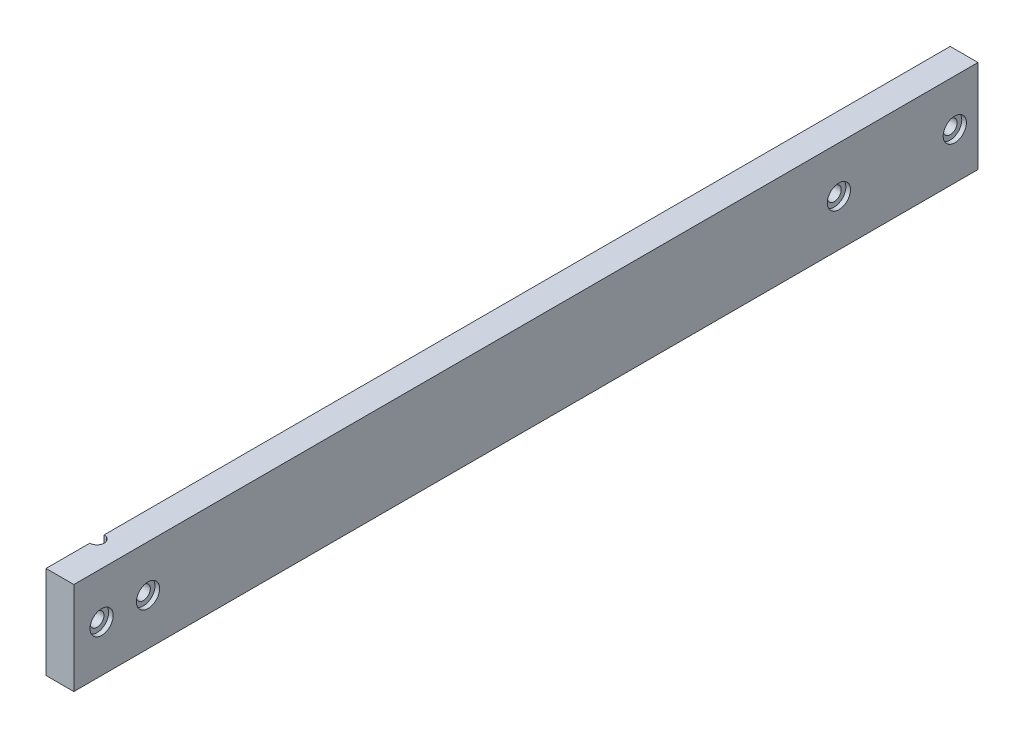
ISO-10303-21;
HEADER;
FILE_DESCRIPTION(('STEP AP214'),'2;1');
FILE_NAME('part.step','',(''),(''),'','','');
FILE_SCHEMA(('AUTOMOTIVE_DESIGN { 1 0 10303 214 1 1 1 1 }'));
ENDSEC;
DATA;
#1=APPLICATION_CONTEXT('core data for automotive mechanical design processes');
#2=APPLICATION_PROTOCOL_DEFINITION('international standard','automotive_design',2000,#1);
#3=PRODUCT_CONTEXT('',#1,'mechanical');
#4=PRODUCT('Part','Part','',(#3));
#5=PRODUCT_RELATED_PRODUCT_CATEGORY('part','',(#4));
#6=PRODUCT_DEFINITION_FORMATION('','',#4);
#7=PRODUCT_DEFINITION_CONTEXT('part definition',#1,'design');
#8=PRODUCT_DEFINITION('design','',#6,#7);
#9=PRODUCT_DEFINITION_SHAPE('','',#8);
#10=(LENGTH_UNIT() NAMED_UNIT(*) SI_UNIT(.MILLI.,.METRE.));
#11=(NAMED_UNIT(*) PLANE_ANGLE_UNIT() SI_UNIT($,.RADIAN.));
#12=(NAMED_UNIT(*) SI_UNIT($,.STERADIAN.) SOLID_ANGLE_UNIT());
#13=UNCERTAINTY_MEASURE_WITH_UNIT(LENGTH_MEASURE(1.E-05),#10,'distance_accuracy_value','');
#14=(GEOMETRIC_REPRESENTATION_CONTEXT(3) GLOBAL_UNCERTAINTY_ASSIGNED_CONTEXT((#13)) GLOBAL_UNIT_ASSIGNED_CONTEXT((#10,
#11,#12)) REPRESENTATION_CONTEXT('',''));
#15=CARTESIAN_POINT('',(0.,0.,0.));
#16=DIRECTION('',(0.,0.,1.));
#17=DIRECTION('',(1.,0.,0.));
#18=AXIS2_PLACEMENT_3D('',#15,#16,#17);
#19=CARTESIAN_POINT('',(0.,20.,0.));
#20=DIRECTION('',(-1.,0.,0.));
#21=DIRECTION('',(0.,0.,1.));
#22=AXIS2_PLACEMENT_3D('',#19,#20,#21);
#23=PLANE('',#22);
#24=DIRECTION('',(0.,-1.,0.));
#25=VECTOR('',#24,1.);
#26=CARTESIAN_POINT('',(0.,20.,-12.55));
#27=LINE('',#26,#25);
#28=CARTESIAN_POINT('',(0.,20.,-12.55));
#29=VERTEX_POINT('',#28);
#30=CARTESIAN_POINT('',(0.,0.,-12.55));
#31=VERTEX_POINT('',#30);
#32=EDGE_CURVE('E83',#29,#31,#27,.T.);
#33=ORIENTED_EDGE('',*,*,#32,.F.);
#34=DIRECTION('',(0.,0.,1.));
#35=VECTOR('',#34,1.);
#36=CARTESIAN_POINT('',(0.,20.,0.));
#37=LINE('',#36,#35);
#38=CARTESIAN_POINT('',(0.,20.,-195.));
#39=VERTEX_POINT('',#38);
#40=EDGE_CURVE('E108',#39,#29,#37,.T.);
#41=ORIENTED_EDGE('',*,*,#40,.F.);
#42=DIRECTION('',(0.,1.,0.));
#43=VECTOR('',#42,1.);
#44=CARTESIAN_POINT('',(0.,0.,-195.));
#45=LINE('',#44,#43);
#46=CARTESIAN_POINT('',(0.,0.,-195.));
#47=VERTEX_POINT('',#46);
#48=EDGE_CURVE('E100',#47,#39,#45,.T.);
#49=ORIENTED_EDGE('',*,*,#48,.F.);
#50=DIRECTION('',(0.,0.,-1.));
#51=VECTOR('',#50,1.);
#52=CARTESIAN_POINT('',(0.,0.,0.));
#53=LINE('',#52,#51);
#54=EDGE_CURVE('E101',#31,#47,#53,.T.);
#55=ORIENTED_EDGE('',*,*,#54,.F.);
#56=EDGE_LOOP('',(#33,#41,#49,#55));
#57=FACE_BOUND('',#56,.T.);
#58=CARTESIAN_POINT('',(0.,10.,-190.));
#59=DIRECTION('',(1.,0.,0.));
#60=DIRECTION('',(0.,0.,-1.));
#61=AXIS2_PLACEMENT_3D('',#58,#59,#60);
#62=CIRCLE('',#61,1.5);
#63=CARTESIAN_POINT('',(0.,10.,-191.5));
#64=VERTEX_POINT('',#63);
#65=EDGE_CURVE('E129',#64,#64,#62,.T.);
#66=ORIENTED_EDGE('',*,*,#65,.T.);
#67=EDGE_LOOP('',(#66));
#68=FACE_BOUND('',#67,.T.);
#69=CARTESIAN_POINT('',(0.,10.,-16.));
#70=DIRECTION('',(1.,0.,0.));
#71=DIRECTION('',(0.,0.,-1.));
#72=AXIS2_PLACEMENT_3D('',#69,#70,#71);
#73=CIRCLE('',#72,1.5);
#74=CARTESIAN_POINT('',(0.,10.,-17.5));
#75=VERTEX_POINT('',#74);
#76=EDGE_CURVE('E163',#75,#75,#73,.T.);
#77=ORIENTED_EDGE('',*,*,#76,.T.);
#78=EDGE_LOOP('',(#77));
#79=FACE_BOUND('',#78,.T.);
#80=CARTESIAN_POINT('',(0.,10.,-165.));
#81=DIRECTION('',(1.,0.,0.));
#82=DIRECTION('',(0.,0.,-1.));
#83=AXIS2_PLACEMENT_3D('',#80,#81,#82);
#84=CIRCLE('',#83,1.5);
#85=CARTESIAN_POINT('',(0.,10.,-166.5));
#86=VERTEX_POINT('',#85);
#87=EDGE_CURVE('E160',#86,#86,#84,.T.);
#88=ORIENTED_EDGE('',*,*,#87,.T.);
#89=EDGE_LOOP('',(#88));
#90=FACE_BOUND('',#89,.T.);
#91=ADVANCED_FACE('F26',(#57,#68,#79,#90),#23,.T.);
#92=CARTESIAN_POINT('',(6.,10.,-190.));
#93=DIRECTION('',(-1.,0.,0.));
#94=DIRECTION('',(0.,0.,1.));
#95=AXIS2_PLACEMENT_3D('',#92,#93,#94);
#96=CYLINDRICAL_SURFACE('',#95,1.5);
#97=ORIENTED_EDGE('',*,*,#65,.F.);
#98=EDGE_LOOP('',(#97));
#99=FACE_BOUND('',#98,.T.);
#100=CARTESIAN_POINT('',(5.,10.,-190.));
#101=DIRECTION('',(1.,0.,0.));
#102=DIRECTION('',(0.,0.,-1.));
#103=AXIS2_PLACEMENT_3D('',#100,#101,#102);
#104=CIRCLE('',#103,1.5);
#105=CARTESIAN_POINT('',(5.,10.,-191.5));
#106=VERTEX_POINT('',#105);
#107=EDGE_CURVE('E30',#106,#106,#104,.T.);
#108=ORIENTED_EDGE('',*,*,#107,.T.);
#109=EDGE_LOOP('',(#108));
#110=FACE_BOUND('',#109,.T.);
#111=ADVANCED_FACE('F185',(#99,#110),#96,.F.);
#112=CARTESIAN_POINT('',(6.,10.,-165.));
#113=DIRECTION('',(-1.,0.,0.));
#114=DIRECTION('',(0.,0.,1.));
#115=AXIS2_PLACEMENT_3D('',#112,#113,#114);
#116=CYLINDRICAL_SURFACE('',#115,1.5);
#117=ORIENTED_EDGE('',*,*,#87,.F.);
#118=EDGE_LOOP('',(#117));
#119=FACE_BOUND('',#118,.T.);
#120=CARTESIAN_POINT('',(5.,10.,-165.));
#121=DIRECTION('',(1.,0.,0.));
#122=DIRECTION('',(0.,0.,-1.));
#123=AXIS2_PLACEMENT_3D('',#120,#121,#122);
#124=CIRCLE('',#123,1.5);
#125=CARTESIAN_POINT('',(5.,10.,-166.5));
#126=VERTEX_POINT('',#125);
#127=EDGE_CURVE('E135',#126,#126,#124,.T.);
#128=ORIENTED_EDGE('',*,*,#127,.T.);
#129=EDGE_LOOP('',(#128));
#130=FACE_BOUND('',#129,.T.);
#131=ADVANCED_FACE('F206',(#119,#130),#116,.F.);
#132=CARTESIAN_POINT('',(6.,10.,-16.));
#133=DIRECTION('',(-1.,0.,0.));
#134=DIRECTION('',(0.,0.,1.));
#135=AXIS2_PLACEMENT_3D('',#132,#133,#134);
#136=CYLINDRICAL_SURFACE('',#135,1.5);
#137=ORIENTED_EDGE('',*,*,#76,.F.);
#138=EDGE_LOOP('',(#137));
#139=FACE_BOUND('',#138,.T.);
#140=CARTESIAN_POINT('',(5.,10.,-16.));
#141=DIRECTION('',(1.,0.,0.));
#142=DIRECTION('',(0.,0.,-1.));
#143=AXIS2_PLACEMENT_3D('',#140,#141,#142);
#144=CIRCLE('',#143,1.5);
#145=CARTESIAN_POINT('',(5.,10.,-17.5));
#146=VERTEX_POINT('',#145);
#147=EDGE_CURVE('E131',#146,#146,#144,.T.);
#148=ORIENTED_EDGE('',*,*,#147,.T.);
#149=EDGE_LOOP('',(#148));
#150=FACE_BOUND('',#149,.T.);
#151=ADVANCED_FACE('F224',(#139,#150),#136,.F.);
#152=CARTESIAN_POINT('',(6.,10.,-6.));
#153=DIRECTION('',(-1.,0.,0.));
#154=DIRECTION('',(0.,0.,1.));
#155=AXIS2_PLACEMENT_3D('',#152,#153,#154);
#156=CYLINDRICAL_SURFACE('',#155,1.5);
#157=CARTESIAN_POINT('',(0.,10.,-6.));
#158=DIRECTION('',(1.,0.,0.));
#159=DIRECTION('',(0.,0.,-1.));
#160=AXIS2_PLACEMENT_3D('',#157,#158,#159);
#161=CIRCLE('',#160,1.5);
#162=CARTESIAN_POINT('',(0.,10.,-7.5));
#163=VERTEX_POINT('',#162);
#164=EDGE_CURVE('E165',#163,#163,#161,.T.);
#165=ORIENTED_EDGE('',*,*,#164,.F.);
#166=EDGE_LOOP('',(#165));
#167=FACE_BOUND('',#166,.T.);
#168=CARTESIAN_POINT('',(5.,10.,-6.));
#169=DIRECTION('',(1.,0.,0.));
#170=DIRECTION('',(0.,0.,-1.));
#171=AXIS2_PLACEMENT_3D('',#168,#169,#170);
#172=CIRCLE('',#171,1.5);
#173=CARTESIAN_POINT('',(5.,10.,-7.5));
#174=VERTEX_POINT('',#173);
#175=EDGE_CURVE('E126',#174,#174,#172,.T.);
#176=ORIENTED_EDGE('',*,*,#175,.T.);
#177=EDGE_LOOP('',(#176));
#178=FACE_BOUND('',#177,.T.);
#179=ADVANCED_FACE('F218',(#167,#178),#156,.F.);
#180=CARTESIAN_POINT('',(6.,20.,0.));
#181=DIRECTION('',(-1.,0.,0.));
#182=DIRECTION('',(0.,0.,1.));
#183=AXIS2_PLACEMENT_3D('',#180,#181,#182);
#184=PLANE('',#183);
#185=CARTESIAN_POINT('',(6.,10.,-190.));
#186=DIRECTION('',(1.,0.,0.));
#187=DIRECTION('',(0.,0.,-1.));
#188=AXIS2_PLACEMENT_3D('',#185,#186,#187);
#189=CIRCLE('',#188,2.5);
#190=CARTESIAN_POINT('',(6.,10.,-192.5));
#191=VERTEX_POINT('',#190);
#192=EDGE_CURVE('E175',#191,#191,#189,.T.);
#193=ORIENTED_EDGE('',*,*,#192,.F.);
#194=EDGE_LOOP('',(#193));
#195=FACE_BOUND('',#194,.T.);
#196=CARTESIAN_POINT('',(6.,10.,-165.));
#197=DIRECTION('',(1.,0.,0.));
#198=DIRECTION('',(0.,0.,-1.));
#199=AXIS2_PLACEMENT_3D('',#196,#197,#198);
#200=CIRCLE('',#199,2.5);
#201=CARTESIAN_POINT('',(6.,10.,-167.5));
#202=VERTEX_POINT('',#201);
#203=EDGE_CURVE('E144',#202,#202,#200,.T.);
#204=ORIENTED_EDGE('',*,*,#203,.F.);
#205=EDGE_LOOP('',(#204));
#206=FACE_BOUND('',#205,.T.);
#207=CARTESIAN_POINT('',(6.,10.,-16.));
#208=DIRECTION('',(1.,0.,0.));
#209=DIRECTION('',(0.,0.,-1.));
#210=AXIS2_PLACEMENT_3D('',#207,#208,#209);
#211=CIRCLE('',#210,2.5);
#212=CARTESIAN_POINT('',(6.,10.,-18.5));
#213=VERTEX_POINT('',#212);
#214=EDGE_CURVE('E137',#213,#213,#211,.T.);
#215=ORIENTED_EDGE('',*,*,#214,.F.);
#216=EDGE_LOOP('',(#215));
#217=FACE_BOUND('',#216,.T.);
#218=CARTESIAN_POINT('',(6.,10.,-6.));
#219=DIRECTION('',(1.,0.,0.));
#220=DIRECTION('',(0.,0.,-1.));
#221=AXIS2_PLACEMENT_3D('',#218,#219,#220);
#222=CIRCLE('',#221,2.5);
#223=CARTESIAN_POINT('',(6.,10.,-8.5));
#224=VERTEX_POINT('',#223);
#225=EDGE_CURVE('E133',#224,#224,#222,.T.);
#226=ORIENTED_EDGE('',*,*,#225,.F.);
#227=EDGE_LOOP('',(#226));
#228=FACE_BOUND('',#227,.T.);
#229=DIRECTION('',(0.,-1.,0.));
#230=VECTOR('',#229,1.);
#231=CARTESIAN_POINT('',(6.,0.,0.));
#232=LINE('',#231,#230);
#233=CARTESIAN_POINT('',(6.,20.,0.));
#234=VERTEX_POINT('',#233);
#235=CARTESIAN_POINT('',(6.,0.,0.));
#236=VERTEX_POINT('',#235);
#237=EDGE_CURVE('E111',#234,#236,#232,.T.);
#238=ORIENTED_EDGE('',*,*,#237,.T.);
#239=DIRECTION('',(0.,0.,-1.));
#240=VECTOR('',#239,1.);
#241=CARTESIAN_POINT('',(6.,0.,0.));
#242=LINE('',#241,#240);
#243=CARTESIAN_POINT('',(6.,0.,-195.));
#244=VERTEX_POINT('',#243);
#245=EDGE_CURVE('E113',#236,#244,#242,.T.);
#246=ORIENTED_EDGE('',*,*,#245,.T.);
#247=DIRECTION('',(0.,1.,0.));
#248=VECTOR('',#247,1.);
#249=CARTESIAN_POINT('',(6.,0.,-195.));
#250=LINE('',#249,#248);
#251=CARTESIAN_POINT('',(6.,20.,-195.));
#252=VERTEX_POINT('',#251);
#253=EDGE_CURVE('E115',#244,#252,#250,.T.);
#254=ORIENTED_EDGE('',*,*,#253,.T.);
#255=DIRECTION('',(0.,0.,1.));
#256=VECTOR('',#255,1.);
#257=CARTESIAN_POINT('',(6.,20.,0.));
#258=LINE('',#257,#256);
#259=EDGE_CURVE('E51',#252,#234,#258,.T.);
#260=ORIENTED_EDGE('',*,*,#259,.T.);
#261=EDGE_LOOP('',(#238,#246,#254,#260));
#262=FACE_BOUND('',#261,.T.);
#263=ADVANCED_FACE('F212',(#195,#206,#217,#228,#262),#184,.F.);
#264=DIRECTION('',(0.,-1.,0.));
#265=VECTOR('',#264,1.);
#266=CARTESIAN_POINT('',(0.,20.,-9.45));
#267=LINE('',#266,#265);
#268=CARTESIAN_POINT('',(0.,20.,-9.45));
#269=VERTEX_POINT('',#268);
#270=CARTESIAN_POINT('',(0.,0.,-9.45));
#271=VERTEX_POINT('',#270);
#272=EDGE_CURVE('E43',#269,#271,#267,.T.);
#273=ORIENTED_EDGE('',*,*,#272,.T.);
#274=CARTESIAN_POINT('',(0.,0.,0.));
#275=VERTEX_POINT('',#274);
#276=EDGE_CURVE('E94',#275,#271,#53,.T.);
#277=ORIENTED_EDGE('',*,*,#276,.F.);
#278=DIRECTION('',(0.,-1.,0.));
#279=VECTOR('',#278,1.);
#280=CARTESIAN_POINT('',(0.,0.,0.));
#281=LINE('',#280,#279);
#282=CARTESIAN_POINT('',(0.,20.,0.));
#283=VERTEX_POINT('',#282);
#284=EDGE_CURVE('E104',#283,#275,#281,.T.);
#285=ORIENTED_EDGE('',*,*,#284,.F.);
#286=EDGE_CURVE('E95',#269,#283,#37,.T.);
#287=ORIENTED_EDGE('',*,*,#286,.F.);
#288=EDGE_LOOP('',(#273,#277,#285,#287));
#289=FACE_BOUND('',#288,.T.);
#290=ORIENTED_EDGE('',*,*,#164,.T.);
#291=EDGE_LOOP('',(#290));
#292=FACE_BOUND('',#291,.T.);
#293=ADVANCED_FACE('F91',(#289,#292),#23,.T.);
#294=CARTESIAN_POINT('',(6.,0.,0.));
#295=DIRECTION('',(0.,0.,-1.));
#296=DIRECTION('',(-1.,0.,0.));
#297=AXIS2_PLACEMENT_3D('',#294,#295,#296);
#298=PLANE('',#297);
#299=ORIENTED_EDGE('',*,*,#284,.T.);
#300=DIRECTION('',(-1.,0.,0.));
#301=VECTOR('',#300,1.);
#302=CARTESIAN_POINT('',(6.,0.,0.));
#303=LINE('',#302,#301);
#304=EDGE_CURVE('E11',#236,#275,#303,.T.);
#305=ORIENTED_EDGE('',*,*,#304,.F.);
#306=ORIENTED_EDGE('',*,*,#237,.F.);
#307=DIRECTION('',(-1.,0.,0.));
#308=VECTOR('',#307,1.);
#309=CARTESIAN_POINT('',(6.,20.,0.));
#310=LINE('',#309,#308);
#311=EDGE_CURVE('E118',#234,#283,#310,.T.);
#312=ORIENTED_EDGE('',*,*,#311,.T.);
#313=EDGE_LOOP('',(#299,#305,#306,#312));
#314=FACE_BOUND('',#313,.T.);
#315=ADVANCED_FACE('F28',(#314),#298,.F.);
#316=CARTESIAN_POINT('',(6.,0.,0.));
#317=DIRECTION('',(0.,1.,0.));
#318=DIRECTION('',(0.,0.,1.));
#319=AXIS2_PLACEMENT_3D('',#316,#317,#318);
#320=PLANE('',#319);
#321=ORIENTED_EDGE('',*,*,#276,.T.);
#322=CARTESIAN_POINT('',(0.,0.,-11.));
#323=DIRECTION('',(0.,-1.,0.));
#324=DIRECTION('',(0.,0.,-1.));
#325=AXIS2_PLACEMENT_3D('',#322,#323,#324);
#326=CIRCLE('',#325,1.55);
#327=EDGE_CURVE('E80',#31,#271,#326,.T.);
#328=ORIENTED_EDGE('',*,*,#327,.F.);
#329=ORIENTED_EDGE('',*,*,#54,.T.);
#330=DIRECTION('',(-1.,0.,0.));
#331=VECTOR('',#330,1.);
#332=CARTESIAN_POINT('',(6.,0.,-195.));
#333=LINE('',#332,#331);
#334=EDGE_CURVE('E35',#244,#47,#333,.T.);
#335=ORIENTED_EDGE('',*,*,#334,.F.);
#336=ORIENTED_EDGE('',*,*,#245,.F.);
#337=ORIENTED_EDGE('',*,*,#304,.T.);
#338=EDGE_LOOP('',(#321,#328,#329,#335,#336,#337));
#339=FACE_BOUND('',#338,.T.);
#340=ADVANCED_FACE('F97',(#339),#320,.F.);
#341=CARTESIAN_POINT('',(6.,0.,-195.));
#342=DIRECTION('',(0.,0.,1.));
#343=DIRECTION('',(1.,0.,0.));
#344=AXIS2_PLACEMENT_3D('',#341,#342,#343);
#345=PLANE('',#344);
#346=ORIENTED_EDGE('',*,*,#48,.T.);
#347=DIRECTION('',(-1.,0.,0.));
#348=VECTOR('',#347,1.);
#349=CARTESIAN_POINT('',(6.,20.,-195.));
#350=LINE('',#349,#348);
#351=EDGE_CURVE('E121',#252,#39,#350,.T.);
#352=ORIENTED_EDGE('',*,*,#351,.F.);
#353=ORIENTED_EDGE('',*,*,#253,.F.);
#354=ORIENTED_EDGE('',*,*,#334,.T.);
#355=EDGE_LOOP('',(#346,#352,#353,#354));
#356=FACE_BOUND('',#355,.T.);
#357=ADVANCED_FACE('F232',(#356),#345,.F.);
#358=CARTESIAN_POINT('',(6.,20.,0.));
#359=DIRECTION('',(0.,-1.,0.));
#360=DIRECTION('',(0.,0.,-1.));
#361=AXIS2_PLACEMENT_3D('',#358,#359,#360);
#362=PLANE('',#361);
#363=ORIENTED_EDGE('',*,*,#40,.T.);
#364=CARTESIAN_POINT('',(0.,20.,-11.));
#365=DIRECTION('',(0.,-1.,0.));
#366=DIRECTION('',(0.,0.,-1.));
#367=AXIS2_PLACEMENT_3D('',#364,#365,#366);
#368=CIRCLE('',#367,1.55);
#369=EDGE_CURVE('E87',#29,#269,#368,.T.);
#370=ORIENTED_EDGE('',*,*,#369,.T.);
#371=ORIENTED_EDGE('',*,*,#286,.T.);
#372=ORIENTED_EDGE('',*,*,#311,.F.);
#373=ORIENTED_EDGE('',*,*,#259,.F.);
#374=ORIENTED_EDGE('',*,*,#351,.T.);
#375=EDGE_LOOP('',(#363,#370,#371,#372,#373,#374));
#376=FACE_BOUND('',#375,.T.);
#377=ADVANCED_FACE('F171',(#376),#362,.F.);
#378=CARTESIAN_POINT('',(5.,10.,-6.));
#379=DIRECTION('',(1.,0.,0.));
#380=DIRECTION('',(0.,0.,-1.));
#381=AXIS2_PLACEMENT_3D('',#378,#379,#380);
#382=CYLINDRICAL_SURFACE('',#381,2.5);
#383=CARTESIAN_POINT('',(5.,10.,-6.));
#384=DIRECTION('',(1.,0.,0.));
#385=DIRECTION('',(0.,0.,-1.));
#386=AXIS2_PLACEMENT_3D('',#383,#384,#385);
#387=CIRCLE('',#386,2.5);
#388=CARTESIAN_POINT('',(5.,10.,-8.5));
#389=VERTEX_POINT('',#388);
#390=EDGE_CURVE('E130',#389,#389,#387,.T.);
#391=ORIENTED_EDGE('',*,*,#390,.F.);
#392=EDGE_LOOP('',(#391));
#393=FACE_BOUND('',#392,.T.);
#394=ORIENTED_EDGE('',*,*,#225,.T.);
#395=EDGE_LOOP('',(#394));
#396=FACE_BOUND('',#395,.T.);
#397=ADVANCED_FACE('F231',(#393,#396),#382,.F.);
#398=CARTESIAN_POINT('',(5.,10.,-6.));
#399=DIRECTION('',(1.,0.,0.));
#400=DIRECTION('',(0.,0.,-1.));
#401=AXIS2_PLACEMENT_3D('',#398,#399,#400);
#402=PLANE('',#401);
#403=ORIENTED_EDGE('',*,*,#175,.F.);
#404=EDGE_LOOP('',(#403));
#405=FACE_BOUND('',#404,.T.);
#406=ORIENTED_EDGE('',*,*,#390,.T.);
#407=EDGE_LOOP('',(#406));
#408=FACE_BOUND('',#407,.T.);
#409=ADVANCED_FACE('F287',(#405,#408),#402,.T.);
#410=CARTESIAN_POINT('',(5.,10.,-16.));
#411=DIRECTION('',(1.,0.,0.));
#412=DIRECTION('',(0.,0.,-1.));
#413=AXIS2_PLACEMENT_3D('',#410,#411,#412);
#414=CYLINDRICAL_SURFACE('',#413,2.5);
#415=CARTESIAN_POINT('',(5.,10.,-16.));
#416=DIRECTION('',(1.,0.,0.));
#417=DIRECTION('',(0.,0.,-1.));
#418=AXIS2_PLACEMENT_3D('',#415,#416,#417);
#419=CIRCLE('',#418,2.5);
#420=CARTESIAN_POINT('',(5.,10.,-18.5));
#421=VERTEX_POINT('',#420);
#422=EDGE_CURVE('E134',#421,#421,#419,.T.);
#423=ORIENTED_EDGE('',*,*,#422,.F.);
#424=EDGE_LOOP('',(#423));
#425=FACE_BOUND('',#424,.T.);
#426=ORIENTED_EDGE('',*,*,#214,.T.);
#427=EDGE_LOOP('',(#426));
#428=FACE_BOUND('',#427,.T.);
#429=ADVANCED_FACE('F279',(#425,#428),#414,.F.);
#430=CARTESIAN_POINT('',(5.,10.,-16.));
#431=DIRECTION('',(1.,0.,0.));
#432=DIRECTION('',(0.,0.,-1.));
#433=AXIS2_PLACEMENT_3D('',#430,#431,#432);
#434=PLANE('',#433);
#435=ORIENTED_EDGE('',*,*,#147,.F.);
#436=EDGE_LOOP('',(#435));
#437=FACE_BOUND('',#436,.T.);
#438=ORIENTED_EDGE('',*,*,#422,.T.);
#439=EDGE_LOOP('',(#438));
#440=FACE_BOUND('',#439,.T.);
#441=ADVANCED_FACE('F271',(#437,#440),#434,.T.);
#442=CARTESIAN_POINT('',(5.,10.,-165.));
#443=DIRECTION('',(1.,0.,0.));
#444=DIRECTION('',(0.,0.,-1.));
#445=AXIS2_PLACEMENT_3D('',#442,#443,#444);
#446=CYLINDRICAL_SURFACE('',#445,2.5);
#447=CARTESIAN_POINT('',(5.,10.,-165.));
#448=DIRECTION('',(1.,0.,0.));
#449=DIRECTION('',(0.,0.,-1.));
#450=AXIS2_PLACEMENT_3D('',#447,#448,#449);
#451=CIRCLE('',#450,2.5);
#452=CARTESIAN_POINT('',(5.,10.,-167.5));
#453=VERTEX_POINT('',#452);
#454=EDGE_CURVE('E138',#453,#453,#451,.T.);
#455=ORIENTED_EDGE('',*,*,#454,.F.);
#456=EDGE_LOOP('',(#455));
#457=FACE_BOUND('',#456,.T.);
#458=ORIENTED_EDGE('',*,*,#203,.T.);
#459=EDGE_LOOP('',(#458));
#460=FACE_BOUND('',#459,.T.);
#461=ADVANCED_FACE('F263',(#457,#460),#446,.F.);
#462=CARTESIAN_POINT('',(5.,10.,-165.));
#463=DIRECTION('',(1.,0.,0.));
#464=DIRECTION('',(0.,0.,-1.));
#465=AXIS2_PLACEMENT_3D('',#462,#463,#464);
#466=PLANE('',#465);
#467=ORIENTED_EDGE('',*,*,#127,.F.);
#468=EDGE_LOOP('',(#467));
#469=FACE_BOUND('',#468,.T.);
#470=ORIENTED_EDGE('',*,*,#454,.T.);
#471=EDGE_LOOP('',(#470));
#472=FACE_BOUND('',#471,.T.);
#473=ADVANCED_FACE('F197',(#469,#472),#466,.T.);
#474=CARTESIAN_POINT('',(5.,10.,-190.));
#475=DIRECTION('',(1.,0.,0.));
#476=DIRECTION('',(0.,0.,-1.));
#477=AXIS2_PLACEMENT_3D('',#474,#475,#476);
#478=CYLINDRICAL_SURFACE('',#477,2.5);
#479=CARTESIAN_POINT('',(5.,10.,-190.));
#480=DIRECTION('',(1.,0.,0.));
#481=DIRECTION('',(0.,0.,-1.));
#482=AXIS2_PLACEMENT_3D('',#479,#480,#481);
#483=CIRCLE('',#482,2.5);
#484=CARTESIAN_POINT('',(5.,10.,-192.5));
#485=VERTEX_POINT('',#484);
#486=EDGE_CURVE('E178',#485,#485,#483,.T.);
#487=ORIENTED_EDGE('',*,*,#486,.F.);
#488=EDGE_LOOP('',(#487));
#489=FACE_BOUND('',#488,.T.);
#490=ORIENTED_EDGE('',*,*,#192,.T.);
#491=EDGE_LOOP('',(#490));
#492=FACE_BOUND('',#491,.T.);
#493=ADVANCED_FACE('F189',(#489,#492),#478,.F.);
#494=CARTESIAN_POINT('',(5.,10.,-190.));
#495=DIRECTION('',(1.,0.,0.));
#496=DIRECTION('',(0.,0.,-1.));
#497=AXIS2_PLACEMENT_3D('',#494,#495,#496);
#498=PLANE('',#497);
#499=ORIENTED_EDGE('',*,*,#107,.F.);
#500=EDGE_LOOP('',(#499));
#501=FACE_BOUND('',#500,.T.);
#502=ORIENTED_EDGE('',*,*,#486,.T.);
#503=EDGE_LOOP('',(#502));
#504=FACE_BOUND('',#503,.T.);
#505=ADVANCED_FACE('F187',(#501,#504),#498,.T.);
#506=CARTESIAN_POINT('',(0.,20.,-11.));
#507=DIRECTION('',(0.,-1.,0.));
#508=DIRECTION('',(0.,0.,-1.));
#509=AXIS2_PLACEMENT_3D('',#506,#507,#508);
#510=CYLINDRICAL_SURFACE('',#509,1.55);
#511=ORIENTED_EDGE('',*,*,#327,.T.);
#512=ORIENTED_EDGE('',*,*,#272,.F.);
#513=ORIENTED_EDGE('',*,*,#369,.F.);
#514=ORIENTED_EDGE('',*,*,#32,.T.);
#515=EDGE_LOOP('',(#511,#512,#513,#514));
#516=FACE_BOUND('',#515,.T.);
#517=ADVANCED_FACE('F81',(#516),#510,.F.);
#518=CLOSED_SHELL('',(#91,#111,#131,#151,#179,#263,#293,#315,#340,#357,#377,#397,#409,#429,#441,
#461,#473,#493,#505,#517));
#519=MANIFOLD_SOLID_BREP('B2',#518);
#520=ADVANCED_BREP_SHAPE_REPRESENTATION('',(#18,#519),#14);
#521=SHAPE_DEFINITION_REPRESENTATION(#9,#520);
ENDSEC;
END-ISO-10303-21;
